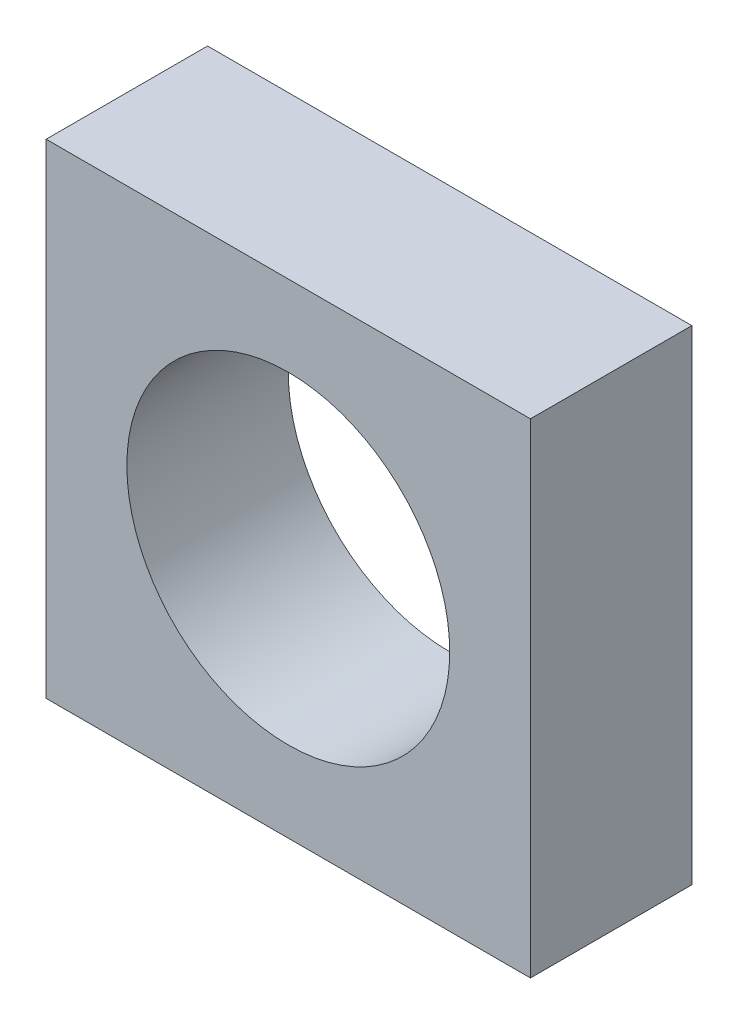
ISO-10303-21;
HEADER;
FILE_DESCRIPTION(('STEP AP214'),'2;1');
FILE_NAME('part.step','',(''),(''),'','','');
FILE_SCHEMA(('AUTOMOTIVE_DESIGN { 1 0 10303 214 1 1 1 1 }'));
ENDSEC;
DATA;
#1=APPLICATION_CONTEXT('core data for automotive mechanical design processes');
#2=APPLICATION_PROTOCOL_DEFINITION('international standard','automotive_design',2000,#1);
#3=PRODUCT_CONTEXT('',#1,'mechanical');
#4=PRODUCT('Part','Part','',(#3));
#5=PRODUCT_RELATED_PRODUCT_CATEGORY('part','',(#4));
#6=PRODUCT_DEFINITION_FORMATION('','',#4);
#7=PRODUCT_DEFINITION_CONTEXT('part definition',#1,'design');
#8=PRODUCT_DEFINITION('design','',#6,#7);
#9=PRODUCT_DEFINITION_SHAPE('','',#8);
#10=(LENGTH_UNIT() NAMED_UNIT(*) SI_UNIT(.MILLI.,.METRE.));
#11=(NAMED_UNIT(*) PLANE_ANGLE_UNIT() SI_UNIT($,.RADIAN.));
#12=(NAMED_UNIT(*) SI_UNIT($,.STERADIAN.) SOLID_ANGLE_UNIT());
#13=UNCERTAINTY_MEASURE_WITH_UNIT(LENGTH_MEASURE(1.E-05),#10,'distance_accuracy_value','');
#14=(GEOMETRIC_REPRESENTATION_CONTEXT(3) GLOBAL_UNCERTAINTY_ASSIGNED_CONTEXT((#13)) GLOBAL_UNIT_ASSIGNED_CONTEXT((#10,
#11,#12)) REPRESENTATION_CONTEXT('',''));
#15=CARTESIAN_POINT('',(0.,0.,0.));
#16=DIRECTION('',(0.,0.,1.));
#17=DIRECTION('',(1.,0.,0.));
#18=AXIS2_PLACEMENT_3D('',#15,#16,#17);
#19=CARTESIAN_POINT('',(0.,150.,-340.));
#20=DIRECTION('',(0.,0.,1.));
#21=DIRECTION('',(-1.,0.,0.));
#22=AXIS2_PLACEMENT_3D('',#19,#20,#21);
#23=PLANE('',#22);
#24=DIRECTION('',(0.,-1.,0.));
#25=VECTOR('',#24,1.);
#26=CARTESIAN_POINT('',(0.,0.,-340.));
#27=LINE('',#26,#25);
#28=CARTESIAN_POINT('',(0.,150.,-340.));
#29=VERTEX_POINT('',#28);
#30=CARTESIAN_POINT('',(0.,0.,-340.));
#31=VERTEX_POINT('',#30);
#32=EDGE_CURVE('E72',#29,#31,#27,.T.);
#33=ORIENTED_EDGE('',*,*,#32,.F.);
#34=DIRECTION('',(-1.,0.,0.));
#35=VECTOR('',#34,1.);
#36=CARTESIAN_POINT('',(0.,150.,-340.));
#37=LINE('',#36,#35);
#38=CARTESIAN_POINT('',(150.,150.,-340.));
#39=VERTEX_POINT('',#38);
#40=EDGE_CURVE('E102',#39,#29,#37,.T.);
#41=ORIENTED_EDGE('',*,*,#40,.F.);
#42=DIRECTION('',(0.,1.,0.));
#43=VECTOR('',#42,1.);
#44=CARTESIAN_POINT('',(150.,0.,-340.));
#45=LINE('',#44,#43);
#46=CARTESIAN_POINT('',(150.,0.,-340.));
#47=VERTEX_POINT('',#46);
#48=EDGE_CURVE('E100',#47,#39,#45,.T.);
#49=ORIENTED_EDGE('',*,*,#48,.F.);
#50=DIRECTION('',(1.,0.,0.));
#51=VECTOR('',#50,1.);
#52=CARTESIAN_POINT('',(0.,0.,-340.));
#53=LINE('',#52,#51);
#54=EDGE_CURVE('E98',#31,#47,#53,.T.);
#55=ORIENTED_EDGE('',*,*,#54,.F.);
#56=EDGE_LOOP('',(#33,#41,#49,#55));
#57=FACE_BOUND('',#56,.T.);
#58=CARTESIAN_POINT('',(75.,75.,-340.));
#59=DIRECTION('',(0.,0.,1.));
#60=DIRECTION('',(1.,0.,0.));
#61=AXIS2_PLACEMENT_3D('',#58,#59,#60);
#62=CIRCLE('',#61,50.);
#63=CARTESIAN_POINT('',(125.,75.,-340.));
#64=VERTEX_POINT('',#63);
#65=EDGE_CURVE('E88',#64,#64,#62,.T.);
#66=ORIENTED_EDGE('',*,*,#65,.T.);
#67=EDGE_LOOP('',(#66));
#68=FACE_BOUND('',#67,.T.);
#69=ADVANCED_FACE('F30',(#57,#68),#23,.F.);
#70=CARTESIAN_POINT('',(0.,150.,-290.));
#71=DIRECTION('',(0.,0.,1.));
#72=DIRECTION('',(-1.,0.,0.));
#73=AXIS2_PLACEMENT_3D('',#70,#71,#72);
#74=PLANE('',#73);
#75=DIRECTION('',(0.,-1.,0.));
#76=VECTOR('',#75,1.);
#77=CARTESIAN_POINT('',(0.,0.,-290.));
#78=LINE('',#77,#76);
#79=CARTESIAN_POINT('',(0.,150.,-290.));
#80=VERTEX_POINT('',#79);
#81=CARTESIAN_POINT('',(0.,0.,-290.));
#82=VERTEX_POINT('',#81);
#83=EDGE_CURVE('E70',#80,#82,#78,.T.);
#84=ORIENTED_EDGE('',*,*,#83,.T.);
#85=DIRECTION('',(1.,0.,0.));
#86=VECTOR('',#85,1.);
#87=CARTESIAN_POINT('',(0.,0.,-290.));
#88=LINE('',#87,#86);
#89=CARTESIAN_POINT('',(150.,0.,-290.));
#90=VERTEX_POINT('',#89);
#91=EDGE_CURVE('E77',#82,#90,#88,.T.);
#92=ORIENTED_EDGE('',*,*,#91,.T.);
#93=DIRECTION('',(0.,1.,0.));
#94=VECTOR('',#93,1.);
#95=CARTESIAN_POINT('',(150.,0.,-290.));
#96=LINE('',#95,#94);
#97=CARTESIAN_POINT('',(150.,150.,-290.));
#98=VERTEX_POINT('',#97);
#99=EDGE_CURVE('E82',#90,#98,#96,.T.);
#100=ORIENTED_EDGE('',*,*,#99,.T.);
#101=DIRECTION('',(-1.,0.,0.));
#102=VECTOR('',#101,1.);
#103=CARTESIAN_POINT('',(0.,150.,-290.));
#104=LINE('',#103,#102);
#105=EDGE_CURVE('E87',#98,#80,#104,.T.);
#106=ORIENTED_EDGE('',*,*,#105,.T.);
#107=EDGE_LOOP('',(#84,#92,#100,#106));
#108=FACE_BOUND('',#107,.T.);
#109=CARTESIAN_POINT('',(75.,75.,-290.));
#110=DIRECTION('',(0.,0.,1.));
#111=DIRECTION('',(1.,0.,0.));
#112=AXIS2_PLACEMENT_3D('',#109,#110,#111);
#113=CIRCLE('',#112,50.);
#114=CARTESIAN_POINT('',(125.,75.,-290.));
#115=VERTEX_POINT('',#114);
#116=EDGE_CURVE('E91',#115,#115,#113,.T.);
#117=ORIENTED_EDGE('',*,*,#116,.F.);
#118=EDGE_LOOP('',(#117));
#119=FACE_BOUND('',#118,.T.);
#120=ADVANCED_FACE('F85',(#108,#119),#74,.T.);
#121=CARTESIAN_POINT('',(0.,0.,-340.));
#122=DIRECTION('',(1.,0.,0.));
#123=DIRECTION('',(0.,0.,1.));
#124=AXIS2_PLACEMENT_3D('',#121,#122,#123);
#125=PLANE('',#124);
#126=ORIENTED_EDGE('',*,*,#83,.F.);
#127=DIRECTION('',(0.,0.,1.));
#128=VECTOR('',#127,1.);
#129=CARTESIAN_POINT('',(0.,150.,-340.));
#130=LINE('',#129,#128);
#131=EDGE_CURVE('E45',#29,#80,#130,.T.);
#132=ORIENTED_EDGE('',*,*,#131,.F.);
#133=ORIENTED_EDGE('',*,*,#32,.T.);
#134=DIRECTION('',(0.,0.,1.));
#135=VECTOR('',#134,1.);
#136=CARTESIAN_POINT('',(0.,0.,-340.));
#137=LINE('',#136,#135);
#138=EDGE_CURVE('E11',#31,#82,#137,.T.);
#139=ORIENTED_EDGE('',*,*,#138,.T.);
#140=EDGE_LOOP('',(#126,#132,#133,#139));
#141=FACE_BOUND('',#140,.T.);
#142=ADVANCED_FACE('F32',(#141),#125,.F.);
#143=CARTESIAN_POINT('',(0.,0.,-340.));
#144=DIRECTION('',(0.,1.,0.));
#145=DIRECTION('',(0.,0.,-1.));
#146=AXIS2_PLACEMENT_3D('',#143,#144,#145);
#147=PLANE('',#146);
#148=ORIENTED_EDGE('',*,*,#91,.F.);
#149=ORIENTED_EDGE('',*,*,#138,.F.);
#150=ORIENTED_EDGE('',*,*,#54,.T.);
#151=DIRECTION('',(0.,0.,1.));
#152=VECTOR('',#151,1.);
#153=CARTESIAN_POINT('',(150.,0.,-340.));
#154=LINE('',#153,#152);
#155=EDGE_CURVE('E38',#47,#90,#154,.T.);
#156=ORIENTED_EDGE('',*,*,#155,.T.);
#157=EDGE_LOOP('',(#148,#149,#150,#156));
#158=FACE_BOUND('',#157,.T.);
#159=ADVANCED_FACE('F78',(#158),#147,.F.);
#160=CARTESIAN_POINT('',(150.,0.,-340.));
#161=DIRECTION('',(-1.,0.,0.));
#162=DIRECTION('',(0.,0.,-1.));
#163=AXIS2_PLACEMENT_3D('',#160,#161,#162);
#164=PLANE('',#163);
#165=ORIENTED_EDGE('',*,*,#99,.F.);
#166=ORIENTED_EDGE('',*,*,#155,.F.);
#167=ORIENTED_EDGE('',*,*,#48,.T.);
#168=DIRECTION('',(0.,0.,1.));
#169=VECTOR('',#168,1.);
#170=CARTESIAN_POINT('',(150.,150.,-340.));
#171=LINE('',#170,#169);
#172=EDGE_CURVE('E52',#39,#98,#171,.T.);
#173=ORIENTED_EDGE('',*,*,#172,.T.);
#174=EDGE_LOOP('',(#165,#166,#167,#173));
#175=FACE_BOUND('',#174,.T.);
#176=ADVANCED_FACE('F106',(#175),#164,.F.);
#177=CARTESIAN_POINT('',(0.,150.,-340.));
#178=DIRECTION('',(0.,-1.,0.));
#179=DIRECTION('',(0.,0.,1.));
#180=AXIS2_PLACEMENT_3D('',#177,#178,#179);
#181=PLANE('',#180);
#182=ORIENTED_EDGE('',*,*,#105,.F.);
#183=ORIENTED_EDGE('',*,*,#172,.F.);
#184=ORIENTED_EDGE('',*,*,#40,.T.);
#185=ORIENTED_EDGE('',*,*,#131,.T.);
#186=EDGE_LOOP('',(#182,#183,#184,#185));
#187=FACE_BOUND('',#186,.T.);
#188=ADVANCED_FACE('F109',(#187),#181,.F.);
#189=CARTESIAN_POINT('',(75.,75.,-340.));
#190=DIRECTION('',(0.,0.,1.));
#191=DIRECTION('',(-1.,0.,0.));
#192=AXIS2_PLACEMENT_3D('',#189,#190,#191);
#193=CYLINDRICAL_SURFACE('',#192,50.);
#194=ORIENTED_EDGE('',*,*,#65,.F.);
#195=EDGE_LOOP('',(#194));
#196=FACE_BOUND('',#195,.T.);
#197=ORIENTED_EDGE('',*,*,#116,.T.);
#198=EDGE_LOOP('',(#197));
#199=FACE_BOUND('',#198,.T.);
#200=ADVANCED_FACE('F116',(#196,#199),#193,.F.);
#201=CLOSED_SHELL('',(#69,#120,#142,#159,#176,#188,#200));
#202=MANIFOLD_SOLID_BREP('B2',#201);
#203=ADVANCED_BREP_SHAPE_REPRESENTATION('',(#18,#202),#14);
#204=SHAPE_DEFINITION_REPRESENTATION(#9,#203);
ENDSEC;
END-ISO-10303-21;
